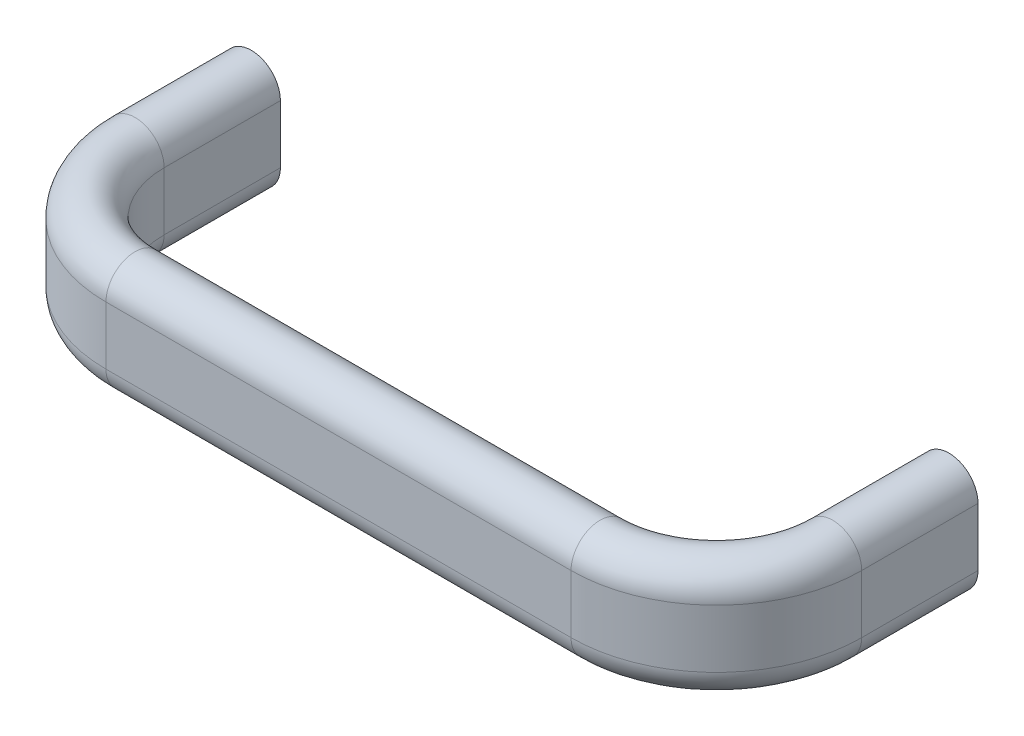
ISO-10303-21;
HEADER;
FILE_DESCRIPTION(('STEP AP214'),'2;1');
FILE_NAME('part.step','',(''),(''),'','','');
FILE_SCHEMA(('AUTOMOTIVE_DESIGN { 1 0 10303 214 1 1 1 1 }'));
ENDSEC;
DATA;
#1=APPLICATION_CONTEXT('core data for automotive mechanical design processes');
#2=APPLICATION_PROTOCOL_DEFINITION('international standard','automotive_design',2000,#1);
#3=PRODUCT_CONTEXT('',#1,'mechanical');
#4=PRODUCT('Part','Part','',(#3));
#5=PRODUCT_RELATED_PRODUCT_CATEGORY('part','',(#4));
#6=PRODUCT_DEFINITION_FORMATION('','',#4);
#7=PRODUCT_DEFINITION_CONTEXT('part definition',#1,'design');
#8=PRODUCT_DEFINITION('design','',#6,#7);
#9=PRODUCT_DEFINITION_SHAPE('','',#8);
#10=(LENGTH_UNIT() NAMED_UNIT(*) SI_UNIT(.MILLI.,.METRE.));
#11=(NAMED_UNIT(*) PLANE_ANGLE_UNIT() SI_UNIT($,.RADIAN.));
#12=(NAMED_UNIT(*) SI_UNIT($,.STERADIAN.) SOLID_ANGLE_UNIT());
#13=UNCERTAINTY_MEASURE_WITH_UNIT(LENGTH_MEASURE(1.E-05),#10,'distance_accuracy_value','');
#14=(GEOMETRIC_REPRESENTATION_CONTEXT(3) GLOBAL_UNCERTAINTY_ASSIGNED_CONTEXT((#13)) GLOBAL_UNIT_ASSIGNED_CONTEXT((#10,
#11,#12)) REPRESENTATION_CONTEXT('',''));
#15=CARTESIAN_POINT('',(0.,0.,0.));
#16=DIRECTION('',(0.,0.,1.));
#17=DIRECTION('',(1.,0.,0.));
#18=AXIS2_PLACEMENT_3D('',#15,#16,#17);
#19=CARTESIAN_POINT('',(-5.,-5.,20.));
#20=DIRECTION('',(-1.,0.,0.));
#21=DIRECTION('',(0.,-1.,0.));
#22=AXIS2_PLACEMENT_3D('',#19,#20,#21);
#23=PLANE('',#22);
#24=DIRECTION('',(0.,1.,0.));
#25=VECTOR('',#24,1.);
#26=CARTESIAN_POINT('',(-5.,-5.,20.));
#27=LINE('',#26,#25);
#28=CARTESIAN_POINT('',(-5.,-5.,20.));
#29=VERTEX_POINT('',#28);
#30=CARTESIAN_POINT('',(-5.,5.,20.));
#31=VERTEX_POINT('',#30);
#32=EDGE_CURVE('E200',#29,#31,#27,.T.);
#33=ORIENTED_EDGE('',*,*,#32,.T.);
#34=DIRECTION('',(0.,0.,-1.));
#35=VECTOR('',#34,1.);
#36=CARTESIAN_POINT('',(-5.,5.,20.));
#37=LINE('',#36,#35);
#38=CARTESIAN_POINT('',(-5.,5.,0.));
#39=VERTEX_POINT('',#38);
#40=EDGE_CURVE('E224',#31,#39,#37,.T.);
#41=ORIENTED_EDGE('',*,*,#40,.T.);
#42=DIRECTION('',(0.,1.,0.));
#43=VECTOR('',#42,1.);
#44=CARTESIAN_POINT('',(-5.,-5.,0.));
#45=LINE('',#44,#43);
#46=CARTESIAN_POINT('',(-5.,-5.,0.));
#47=VERTEX_POINT('',#46);
#48=EDGE_CURVE('E222',#47,#39,#45,.T.);
#49=ORIENTED_EDGE('',*,*,#48,.F.);
#50=DIRECTION('',(0.,0.,-1.));
#51=VECTOR('',#50,1.);
#52=CARTESIAN_POINT('',(-5.,-5.,20.));
#53=LINE('',#52,#51);
#54=EDGE_CURVE('E227',#29,#47,#53,.T.);
#55=ORIENTED_EDGE('',*,*,#54,.F.);
#56=EDGE_LOOP('',(#33,#41,#49,#55));
#57=FACE_BOUND('',#56,.T.);
#58=ADVANCED_FACE('F14',(#57),#23,.T.);
#59=CARTESIAN_POINT('',(0.,5.,20.));
#60=DIRECTION('',(0.,0.,-1.));
#61=DIRECTION('',(0.,-1.,0.));
#62=AXIS2_PLACEMENT_3D('',#59,#60,#61);
#63=CYLINDRICAL_SURFACE('',#62,5.);
#64=CARTESIAN_POINT('',(0.,5.,20.));
#65=DIRECTION('',(0.,0.,-1.));
#66=DIRECTION('',(0.,1.,0.));
#67=AXIS2_PLACEMENT_3D('',#64,#65,#66);
#68=CIRCLE('',#67,5.);
#69=CARTESIAN_POINT('',(5.,5.,20.));
#70=VERTEX_POINT('',#69);
#71=EDGE_CURVE('E213',#31,#70,#68,.T.);
#72=ORIENTED_EDGE('',*,*,#71,.T.);
#73=DIRECTION('',(0.,0.,-1.));
#74=VECTOR('',#73,1.);
#75=CARTESIAN_POINT('',(5.,5.,20.));
#76=LINE('',#75,#74);
#77=CARTESIAN_POINT('',(5.,5.,0.));
#78=VERTEX_POINT('',#77);
#79=EDGE_CURVE('E221',#70,#78,#76,.T.);
#80=ORIENTED_EDGE('',*,*,#79,.T.);
#81=CARTESIAN_POINT('',(0.,5.,0.));
#82=DIRECTION('',(0.,0.,-1.));
#83=DIRECTION('',(0.,1.,0.));
#84=AXIS2_PLACEMENT_3D('',#81,#82,#83);
#85=CIRCLE('',#84,5.);
#86=EDGE_CURVE('E36',#39,#78,#85,.T.);
#87=ORIENTED_EDGE('',*,*,#86,.F.);
#88=ORIENTED_EDGE('',*,*,#40,.F.);
#89=EDGE_LOOP('',(#72,#80,#87,#88));
#90=FACE_BOUND('',#89,.T.);
#91=ADVANCED_FACE('F278',(#90),#63,.T.);
#92=CARTESIAN_POINT('',(5.,5.,20.));
#93=DIRECTION('',(1.,0.,0.));
#94=DIRECTION('',(0.,1.,0.));
#95=AXIS2_PLACEMENT_3D('',#92,#93,#94);
#96=PLANE('',#95);
#97=DIRECTION('',(0.,-1.,0.));
#98=VECTOR('',#97,1.);
#99=CARTESIAN_POINT('',(5.,5.,20.));
#100=LINE('',#99,#98);
#101=CARTESIAN_POINT('',(5.,-5.,20.));
#102=VERTEX_POINT('',#101);
#103=EDGE_CURVE('E210',#70,#102,#100,.T.);
#104=ORIENTED_EDGE('',*,*,#103,.T.);
#105=DIRECTION('',(0.,0.,-1.));
#106=VECTOR('',#105,1.);
#107=CARTESIAN_POINT('',(5.,-5.,20.));
#108=LINE('',#107,#106);
#109=CARTESIAN_POINT('',(5.,-5.,0.));
#110=VERTEX_POINT('',#109);
#111=EDGE_CURVE('E218',#102,#110,#108,.T.);
#112=ORIENTED_EDGE('',*,*,#111,.T.);
#113=DIRECTION('',(0.,-1.,0.));
#114=VECTOR('',#113,1.);
#115=CARTESIAN_POINT('',(5.,5.,0.));
#116=LINE('',#115,#114);
#117=EDGE_CURVE('E231',#78,#110,#116,.T.);
#118=ORIENTED_EDGE('',*,*,#117,.F.);
#119=ORIENTED_EDGE('',*,*,#79,.F.);
#120=EDGE_LOOP('',(#104,#112,#118,#119));
#121=FACE_BOUND('',#120,.T.);
#122=ADVANCED_FACE('F284',(#121),#96,.T.);
#123=CARTESIAN_POINT('',(0.,-5.,20.));
#124=DIRECTION('',(0.,0.,-1.));
#125=DIRECTION('',(0.,-1.,0.));
#126=AXIS2_PLACEMENT_3D('',#123,#124,#125);
#127=CYLINDRICAL_SURFACE('',#126,5.);
#128=CARTESIAN_POINT('',(0.,-5.,20.));
#129=DIRECTION('',(0.,0.,-1.));
#130=DIRECTION('',(0.,1.,0.));
#131=AXIS2_PLACEMENT_3D('',#128,#129,#130);
#132=CIRCLE('',#131,5.);
#133=EDGE_CURVE('E186',#102,#29,#132,.T.);
#134=ORIENTED_EDGE('',*,*,#133,.T.);
#135=ORIENTED_EDGE('',*,*,#54,.T.);
#136=CARTESIAN_POINT('',(0.,-5.,0.));
#137=DIRECTION('',(0.,0.,-1.));
#138=DIRECTION('',(0.,1.,0.));
#139=AXIS2_PLACEMENT_3D('',#136,#137,#138);
#140=CIRCLE('',#139,5.);
#141=EDGE_CURVE('E28',#110,#47,#140,.T.);
#142=ORIENTED_EDGE('',*,*,#141,.F.);
#143=ORIENTED_EDGE('',*,*,#111,.F.);
#144=EDGE_LOOP('',(#134,#135,#142,#143));
#145=FACE_BOUND('',#144,.T.);
#146=ADVANCED_FACE('F303',(#145),#127,.T.);
#147=CARTESIAN_POINT('',(20.,0.,20.));
#148=DIRECTION('',(0.,-1.,0.));
#149=DIRECTION('',(1.,0.,0.));
#150=AXIS2_PLACEMENT_3D('',#147,#148,#149);
#151=CYLINDRICAL_SURFACE('',#150,25.);
#152=DIRECTION('',(0.,1.,0.));
#153=VECTOR('',#152,1.);
#154=CARTESIAN_POINT('',(20.,-5.,45.));
#155=LINE('',#154,#153);
#156=CARTESIAN_POINT('',(20.,-5.,45.));
#157=VERTEX_POINT('',#156);
#158=CARTESIAN_POINT('',(20.,5.,45.));
#159=VERTEX_POINT('',#158);
#160=EDGE_CURVE('E177',#157,#159,#155,.T.);
#161=ORIENTED_EDGE('',*,*,#160,.T.);
#162=CARTESIAN_POINT('',(20.,5.,20.));
#163=DIRECTION('',(0.,-1.,0.));
#164=DIRECTION('',(1.,0.,0.));
#165=AXIS2_PLACEMENT_3D('',#162,#163,#164);
#166=CIRCLE('',#165,25.);
#167=EDGE_CURVE('E203',#159,#31,#166,.T.);
#168=ORIENTED_EDGE('',*,*,#167,.T.);
#169=ORIENTED_EDGE('',*,*,#32,.F.);
#170=CARTESIAN_POINT('',(20.,-5.,20.));
#171=DIRECTION('',(0.,-1.,0.));
#172=DIRECTION('',(1.,0.,0.));
#173=AXIS2_PLACEMENT_3D('',#170,#171,#172);
#174=CIRCLE('',#173,25.);
#175=EDGE_CURVE('E206',#157,#29,#174,.T.);
#176=ORIENTED_EDGE('',*,*,#175,.F.);
#177=EDGE_LOOP('',(#161,#168,#169,#176));
#178=FACE_BOUND('',#177,.T.);
#179=ADVANCED_FACE('F290',(#178),#151,.T.);
#180=CARTESIAN_POINT('',(20.,5.,20.));
#181=DIRECTION('',(0.,-1.,0.));
#182=DIRECTION('',(1.,0.,0.));
#183=AXIS2_PLACEMENT_3D('',#180,#181,#182);
#184=TOROIDAL_SURFACE('',#183,20.,5.);
#185=CARTESIAN_POINT('',(20.,5.,40.));
#186=DIRECTION('',(-1.,0.,0.));
#187=DIRECTION('',(0.,1.,0.));
#188=AXIS2_PLACEMENT_3D('',#185,#186,#187);
#189=CIRCLE('',#188,5.);
#190=CARTESIAN_POINT('',(20.,5.,35.));
#191=VERTEX_POINT('',#190);
#192=EDGE_CURVE('E191',#159,#191,#189,.T.);
#193=ORIENTED_EDGE('',*,*,#192,.T.);
#194=CARTESIAN_POINT('',(20.,5.,20.));
#195=DIRECTION('',(0.,-1.,0.));
#196=DIRECTION('',(1.,0.,0.));
#197=AXIS2_PLACEMENT_3D('',#194,#195,#196);
#198=CIRCLE('',#197,15.);
#199=EDGE_CURVE('E199',#191,#70,#198,.T.);
#200=ORIENTED_EDGE('',*,*,#199,.T.);
#201=ORIENTED_EDGE('',*,*,#71,.F.);
#202=ORIENTED_EDGE('',*,*,#167,.F.);
#203=EDGE_LOOP('',(#193,#200,#201,#202));
#204=FACE_BOUND('',#203,.T.);
#205=ADVANCED_FACE('F293',(#204),#184,.T.);
#206=CARTESIAN_POINT('',(20.,0.,20.));
#207=DIRECTION('',(0.,-1.,0.));
#208=DIRECTION('',(1.,0.,0.));
#209=AXIS2_PLACEMENT_3D('',#206,#207,#208);
#210=CYLINDRICAL_SURFACE('',#209,15.);
#211=DIRECTION('',(0.,-1.,0.));
#212=VECTOR('',#211,1.);
#213=CARTESIAN_POINT('',(20.,5.,35.));
#214=LINE('',#213,#212);
#215=CARTESIAN_POINT('',(20.,-5.,35.));
#216=VERTEX_POINT('',#215);
#217=EDGE_CURVE('E188',#191,#216,#214,.T.);
#218=ORIENTED_EDGE('',*,*,#217,.T.);
#219=CARTESIAN_POINT('',(20.,-5.,20.));
#220=DIRECTION('',(0.,-1.,0.));
#221=DIRECTION('',(1.,0.,0.));
#222=AXIS2_PLACEMENT_3D('',#219,#220,#221);
#223=CIRCLE('',#222,15.);
#224=EDGE_CURVE('E196',#216,#102,#223,.T.);
#225=ORIENTED_EDGE('',*,*,#224,.T.);
#226=ORIENTED_EDGE('',*,*,#103,.F.);
#227=ORIENTED_EDGE('',*,*,#199,.F.);
#228=EDGE_LOOP('',(#218,#225,#226,#227));
#229=FACE_BOUND('',#228,.T.);
#230=ADVANCED_FACE('F297',(#229),#210,.F.);
#231=CARTESIAN_POINT('',(20.,-5.,20.));
#232=DIRECTION('',(0.,-1.,0.));
#233=DIRECTION('',(1.,0.,0.));
#234=AXIS2_PLACEMENT_3D('',#231,#232,#233);
#235=TOROIDAL_SURFACE('',#234,20.,5.);
#236=CARTESIAN_POINT('',(20.,-5.,40.));
#237=DIRECTION('',(-1.,0.,0.));
#238=DIRECTION('',(0.,1.,0.));
#239=AXIS2_PLACEMENT_3D('',#236,#237,#238);
#240=CIRCLE('',#239,5.);
#241=EDGE_CURVE('E163',#216,#157,#240,.T.);
#242=ORIENTED_EDGE('',*,*,#241,.T.);
#243=ORIENTED_EDGE('',*,*,#175,.T.);
#244=ORIENTED_EDGE('',*,*,#133,.F.);
#245=ORIENTED_EDGE('',*,*,#224,.F.);
#246=EDGE_LOOP('',(#242,#243,#244,#245));
#247=FACE_BOUND('',#246,.T.);
#248=ADVANCED_FACE('F301',(#247),#235,.T.);
#249=CARTESIAN_POINT('',(100.,-5.,45.));
#250=DIRECTION('',(0.,0.,1.));
#251=DIRECTION('',(1.,0.,0.));
#252=AXIS2_PLACEMENT_3D('',#249,#250,#251);
#253=PLANE('',#252);
#254=DIRECTION('',(0.,1.,0.));
#255=VECTOR('',#254,1.);
#256=CARTESIAN_POINT('',(100.,-5.,45.));
#257=LINE('',#256,#255);
#258=CARTESIAN_POINT('',(100.,-5.,45.));
#259=VERTEX_POINT('',#258);
#260=CARTESIAN_POINT('',(100.,5.,45.));
#261=VERTEX_POINT('',#260);
#262=EDGE_CURVE('E154',#259,#261,#257,.T.);
#263=ORIENTED_EDGE('',*,*,#262,.T.);
#264=DIRECTION('',(-1.,0.,0.));
#265=VECTOR('',#264,1.);
#266=CARTESIAN_POINT('',(100.,5.,45.));
#267=LINE('',#266,#265);
#268=EDGE_CURVE('E180',#261,#159,#267,.T.);
#269=ORIENTED_EDGE('',*,*,#268,.T.);
#270=ORIENTED_EDGE('',*,*,#160,.F.);
#271=DIRECTION('',(-1.,0.,0.));
#272=VECTOR('',#271,1.);
#273=CARTESIAN_POINT('',(100.,-5.,45.));
#274=LINE('',#273,#272);
#275=EDGE_CURVE('E183',#259,#157,#274,.T.);
#276=ORIENTED_EDGE('',*,*,#275,.F.);
#277=EDGE_LOOP('',(#263,#269,#270,#276));
#278=FACE_BOUND('',#277,.T.);
#279=ADVANCED_FACE('F354',(#278),#253,.T.);
#280=CARTESIAN_POINT('',(100.,5.,40.));
#281=DIRECTION('',(-1.,0.,0.));
#282=DIRECTION('',(0.,0.,1.));
#283=AXIS2_PLACEMENT_3D('',#280,#281,#282);
#284=CYLINDRICAL_SURFACE('',#283,5.);
#285=CARTESIAN_POINT('',(100.,5.,40.));
#286=DIRECTION('',(-1.,0.,0.));
#287=DIRECTION('',(0.,1.,0.));
#288=AXIS2_PLACEMENT_3D('',#285,#286,#287);
#289=CIRCLE('',#288,5.);
#290=CARTESIAN_POINT('',(100.,5.,35.));
#291=VERTEX_POINT('',#290);
#292=EDGE_CURVE('E168',#261,#291,#289,.T.);
#293=ORIENTED_EDGE('',*,*,#292,.T.);
#294=DIRECTION('',(-1.,0.,0.));
#295=VECTOR('',#294,1.);
#296=CARTESIAN_POINT('',(100.,5.,35.));
#297=LINE('',#296,#295);
#298=EDGE_CURVE('E176',#291,#191,#297,.T.);
#299=ORIENTED_EDGE('',*,*,#298,.T.);
#300=ORIENTED_EDGE('',*,*,#192,.F.);
#301=ORIENTED_EDGE('',*,*,#268,.F.);
#302=EDGE_LOOP('',(#293,#299,#300,#301));
#303=FACE_BOUND('',#302,.T.);
#304=ADVANCED_FACE('F350',(#303),#284,.T.);
#305=CARTESIAN_POINT('',(100.,5.,35.));
#306=DIRECTION('',(0.,0.,-1.));
#307=DIRECTION('',(-1.,0.,0.));
#308=AXIS2_PLACEMENT_3D('',#305,#306,#307);
#309=PLANE('',#308);
#310=DIRECTION('',(0.,-1.,0.));
#311=VECTOR('',#310,1.);
#312=CARTESIAN_POINT('',(100.,5.,35.));
#313=LINE('',#312,#311);
#314=CARTESIAN_POINT('',(100.,-5.,35.));
#315=VERTEX_POINT('',#314);
#316=EDGE_CURVE('E165',#291,#315,#313,.T.);
#317=ORIENTED_EDGE('',*,*,#316,.T.);
#318=DIRECTION('',(-1.,0.,0.));
#319=VECTOR('',#318,1.);
#320=CARTESIAN_POINT('',(100.,-5.,35.));
#321=LINE('',#320,#319);
#322=EDGE_CURVE('E173',#315,#216,#321,.T.);
#323=ORIENTED_EDGE('',*,*,#322,.T.);
#324=ORIENTED_EDGE('',*,*,#217,.F.);
#325=ORIENTED_EDGE('',*,*,#298,.F.);
#326=EDGE_LOOP('',(#317,#323,#324,#325));
#327=FACE_BOUND('',#326,.T.);
#328=ADVANCED_FACE('F346',(#327),#309,.T.);
#329=CARTESIAN_POINT('',(100.,-5.,40.));
#330=DIRECTION('',(-1.,0.,0.));
#331=DIRECTION('',(0.,0.,1.));
#332=AXIS2_PLACEMENT_3D('',#329,#330,#331);
#333=CYLINDRICAL_SURFACE('',#332,5.);
#334=CARTESIAN_POINT('',(100.,-5.,40.));
#335=DIRECTION('',(-1.,0.,0.));
#336=DIRECTION('',(0.,1.,0.));
#337=AXIS2_PLACEMENT_3D('',#334,#335,#336);
#338=CIRCLE('',#337,5.);
#339=EDGE_CURVE('E126',#315,#259,#338,.T.);
#340=ORIENTED_EDGE('',*,*,#339,.T.);
#341=ORIENTED_EDGE('',*,*,#275,.T.);
#342=ORIENTED_EDGE('',*,*,#241,.F.);
#343=ORIENTED_EDGE('',*,*,#322,.F.);
#344=EDGE_LOOP('',(#340,#341,#342,#343));
#345=FACE_BOUND('',#344,.T.);
#346=ADVANCED_FACE('F342',(#345),#333,.T.);
#347=CARTESIAN_POINT('',(100.,0.,20.));
#348=DIRECTION('',(0.,-1.,0.));
#349=DIRECTION('',(1.,0.,0.));
#350=AXIS2_PLACEMENT_3D('',#347,#348,#349);
#351=CYLINDRICAL_SURFACE('',#350,25.);
#352=DIRECTION('',(0.,1.,0.));
#353=VECTOR('',#352,1.);
#354=CARTESIAN_POINT('',(125.,-5.,20.));
#355=LINE('',#354,#353);
#356=CARTESIAN_POINT('',(125.,-5.,20.));
#357=VERTEX_POINT('',#356);
#358=CARTESIAN_POINT('',(125.,5.,20.));
#359=VERTEX_POINT('',#358);
#360=EDGE_CURVE('E125',#357,#359,#355,.T.);
#361=ORIENTED_EDGE('',*,*,#360,.T.);
#362=CARTESIAN_POINT('',(100.,5.,20.));
#363=DIRECTION('',(0.,-1.,0.));
#364=DIRECTION('',(1.,0.,0.));
#365=AXIS2_PLACEMENT_3D('',#362,#363,#364);
#366=CIRCLE('',#365,25.);
#367=EDGE_CURVE('E157',#359,#261,#366,.T.);
#368=ORIENTED_EDGE('',*,*,#367,.T.);
#369=ORIENTED_EDGE('',*,*,#262,.F.);
#370=CARTESIAN_POINT('',(100.,-5.,20.));
#371=DIRECTION('',(0.,-1.,0.));
#372=DIRECTION('',(1.,0.,0.));
#373=AXIS2_PLACEMENT_3D('',#370,#371,#372);
#374=CIRCLE('',#373,25.);
#375=EDGE_CURVE('E160',#357,#259,#374,.T.);
#376=ORIENTED_EDGE('',*,*,#375,.F.);
#377=EDGE_LOOP('',(#361,#368,#369,#376));
#378=FACE_BOUND('',#377,.T.);
#379=ADVANCED_FACE('F338',(#378),#351,.T.);
#380=CARTESIAN_POINT('',(100.,5.,20.));
#381=DIRECTION('',(0.,-1.,0.));
#382=DIRECTION('',(1.,0.,0.));
#383=AXIS2_PLACEMENT_3D('',#380,#381,#382);
#384=TOROIDAL_SURFACE('',#383,20.,5.);
#385=CARTESIAN_POINT('',(120.,5.,20.));
#386=DIRECTION('',(0.,0.,1.));
#387=DIRECTION('',(0.,1.,0.));
#388=AXIS2_PLACEMENT_3D('',#385,#386,#387);
#389=CIRCLE('',#388,5.);
#390=CARTESIAN_POINT('',(115.,5.,20.));
#391=VERTEX_POINT('',#390);
#392=EDGE_CURVE('E140',#359,#391,#389,.T.);
#393=ORIENTED_EDGE('',*,*,#392,.T.);
#394=CARTESIAN_POINT('',(100.,5.,20.));
#395=DIRECTION('',(0.,-1.,0.));
#396=DIRECTION('',(1.,0.,0.));
#397=AXIS2_PLACEMENT_3D('',#394,#395,#396);
#398=CIRCLE('',#397,15.);
#399=EDGE_CURVE('E153',#391,#291,#398,.T.);
#400=ORIENTED_EDGE('',*,*,#399,.T.);
#401=ORIENTED_EDGE('',*,*,#292,.F.);
#402=ORIENTED_EDGE('',*,*,#367,.F.);
#403=EDGE_LOOP('',(#393,#400,#401,#402));
#404=FACE_BOUND('',#403,.T.);
#405=ADVANCED_FACE('F334',(#404),#384,.T.);
#406=CARTESIAN_POINT('',(100.,0.,20.));
#407=DIRECTION('',(0.,-1.,0.));
#408=DIRECTION('',(1.,0.,0.));
#409=AXIS2_PLACEMENT_3D('',#406,#407,#408);
#410=CYLINDRICAL_SURFACE('',#409,15.);
#411=DIRECTION('',(0.,-1.,0.));
#412=VECTOR('',#411,1.);
#413=CARTESIAN_POINT('',(115.,5.,20.));
#414=LINE('',#413,#412);
#415=CARTESIAN_POINT('',(115.,-5.,20.));
#416=VERTEX_POINT('',#415);
#417=EDGE_CURVE('E142',#391,#416,#414,.T.);
#418=ORIENTED_EDGE('',*,*,#417,.T.);
#419=CARTESIAN_POINT('',(100.,-5.,20.));
#420=DIRECTION('',(0.,-1.,0.));
#421=DIRECTION('',(1.,0.,0.));
#422=AXIS2_PLACEMENT_3D('',#419,#420,#421);
#423=CIRCLE('',#422,15.);
#424=EDGE_CURVE('E150',#416,#315,#423,.T.);
#425=ORIENTED_EDGE('',*,*,#424,.T.);
#426=ORIENTED_EDGE('',*,*,#316,.F.);
#427=ORIENTED_EDGE('',*,*,#399,.F.);
#428=EDGE_LOOP('',(#418,#425,#426,#427));
#429=FACE_BOUND('',#428,.T.);
#430=ADVANCED_FACE('F330',(#429),#410,.F.);
#431=CARTESIAN_POINT('',(100.,-5.,20.));
#432=DIRECTION('',(0.,-1.,0.));
#433=DIRECTION('',(1.,0.,0.));
#434=AXIS2_PLACEMENT_3D('',#431,#432,#433);
#435=TOROIDAL_SURFACE('',#434,20.,5.);
#436=CARTESIAN_POINT('',(120.,-5.,20.));
#437=DIRECTION('',(0.,0.,1.));
#438=DIRECTION('',(0.,1.,0.));
#439=AXIS2_PLACEMENT_3D('',#436,#437,#438);
#440=CIRCLE('',#439,5.);
#441=EDGE_CURVE('E137',#416,#357,#440,.T.);
#442=ORIENTED_EDGE('',*,*,#441,.T.);
#443=ORIENTED_EDGE('',*,*,#375,.T.);
#444=ORIENTED_EDGE('',*,*,#339,.F.);
#445=ORIENTED_EDGE('',*,*,#424,.F.);
#446=EDGE_LOOP('',(#442,#443,#444,#445));
#447=FACE_BOUND('',#446,.T.);
#448=ADVANCED_FACE('F327',(#447),#435,.T.);
#449=CARTESIAN_POINT('',(120.,-5.,20.));
#450=DIRECTION('',(0.,0.,-1.));
#451=DIRECTION('',(-1.,0.,0.));
#452=AXIS2_PLACEMENT_3D('',#449,#450,#451);
#453=CYLINDRICAL_SURFACE('',#452,5.);
#454=DIRECTION('',(0.,0.,-1.));
#455=VECTOR('',#454,1.);
#456=CARTESIAN_POINT('',(125.,-5.,20.));
#457=LINE('',#456,#455);
#458=CARTESIAN_POINT('',(125.,-5.,-1.49167968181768E-13));
#459=VERTEX_POINT('',#458);
#460=EDGE_CURVE('E108',#357,#459,#457,.T.);
#461=ORIENTED_EDGE('',*,*,#460,.F.);
#462=ORIENTED_EDGE('',*,*,#441,.F.);
#463=DIRECTION('',(0.,0.,-1.));
#464=VECTOR('',#463,1.);
#465=CARTESIAN_POINT('',(115.,-5.,20.));
#466=LINE('',#465,#464);
#467=CARTESIAN_POINT('',(115.,-5.,-1.43151412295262E-13));
#468=VERTEX_POINT('',#467);
#469=EDGE_CURVE('E111',#416,#468,#466,.T.);
#470=ORIENTED_EDGE('',*,*,#469,.T.);
#471=CARTESIAN_POINT('',(120.,-5.,-1.46159690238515E-13));
#472=DIRECTION('',(0.,0.,1.));
#473=DIRECTION('',(0.,1.,0.));
#474=AXIS2_PLACEMENT_3D('',#471,#472,#473);
#475=CIRCLE('',#474,5.);
#476=EDGE_CURVE('E104',#468,#459,#475,.T.);
#477=ORIENTED_EDGE('',*,*,#476,.T.);
#478=EDGE_LOOP('',(#461,#462,#470,#477));
#479=FACE_BOUND('',#478,.T.);
#480=ADVANCED_FACE('F106',(#479),#453,.T.);
#481=CARTESIAN_POINT('',(125.,-5.,20.));
#482=DIRECTION('',(-1.,0.,0.));
#483=DIRECTION('',(0.,0.,1.));
#484=AXIS2_PLACEMENT_3D('',#481,#482,#483);
#485=PLANE('',#484);
#486=DIRECTION('',(0.,0.,-1.));
#487=VECTOR('',#486,1.);
#488=CARTESIAN_POINT('',(125.,5.,20.));
#489=LINE('',#488,#487);
#490=CARTESIAN_POINT('',(125.,5.,-1.49167968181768E-13));
#491=VERTEX_POINT('',#490);
#492=EDGE_CURVE('E127',#359,#491,#489,.T.);
#493=ORIENTED_EDGE('',*,*,#492,.F.);
#494=ORIENTED_EDGE('',*,*,#360,.F.);
#495=ORIENTED_EDGE('',*,*,#460,.T.);
#496=DIRECTION('',(0.,1.,0.));
#497=VECTOR('',#496,1.);
#498=CARTESIAN_POINT('',(125.,-5.,-1.49167968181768E-13));
#499=LINE('',#498,#497);
#500=EDGE_CURVE('E116',#459,#491,#499,.T.);
#501=ORIENTED_EDGE('',*,*,#500,.T.);
#502=EDGE_LOOP('',(#493,#494,#495,#501));
#503=FACE_BOUND('',#502,.T.);
#504=ADVANCED_FACE('F122',(#503),#485,.F.);
#505=CARTESIAN_POINT('',(120.,5.,20.));
#506=DIRECTION('',(0.,0.,-1.));
#507=DIRECTION('',(-1.,0.,0.));
#508=AXIS2_PLACEMENT_3D('',#505,#506,#507);
#509=CYLINDRICAL_SURFACE('',#508,5.);
#510=DIRECTION('',(0.,0.,-1.));
#511=VECTOR('',#510,1.);
#512=CARTESIAN_POINT('',(115.,5.,20.));
#513=LINE('',#512,#511);
#514=CARTESIAN_POINT('',(115.,5.,-1.43151412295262E-13));
#515=VERTEX_POINT('',#514);
#516=EDGE_CURVE('E146',#391,#515,#513,.T.);
#517=ORIENTED_EDGE('',*,*,#516,.F.);
#518=ORIENTED_EDGE('',*,*,#392,.F.);
#519=ORIENTED_EDGE('',*,*,#492,.T.);
#520=CARTESIAN_POINT('',(120.,5.,-1.46159690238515E-13));
#521=DIRECTION('',(0.,0.,1.));
#522=DIRECTION('',(0.,1.,0.));
#523=AXIS2_PLACEMENT_3D('',#520,#521,#522);
#524=CIRCLE('',#523,5.);
#525=EDGE_CURVE('E130',#491,#515,#524,.T.);
#526=ORIENTED_EDGE('',*,*,#525,.T.);
#527=EDGE_LOOP('',(#517,#518,#519,#526));
#528=FACE_BOUND('',#527,.T.);
#529=ADVANCED_FACE('F307',(#528),#509,.T.);
#530=CARTESIAN_POINT('',(115.,5.,20.));
#531=DIRECTION('',(1.,0.,0.));
#532=DIRECTION('',(0.,0.,-1.));
#533=AXIS2_PLACEMENT_3D('',#530,#531,#532);
#534=PLANE('',#533);
#535=ORIENTED_EDGE('',*,*,#417,.F.);
#536=ORIENTED_EDGE('',*,*,#516,.T.);
#537=DIRECTION('',(0.,-1.,0.));
#538=VECTOR('',#537,1.);
#539=CARTESIAN_POINT('',(115.,5.,-1.43151412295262E-13));
#540=LINE('',#539,#538);
#541=EDGE_CURVE('E132',#515,#468,#540,.T.);
#542=ORIENTED_EDGE('',*,*,#541,.T.);
#543=ORIENTED_EDGE('',*,*,#469,.F.);
#544=EDGE_LOOP('',(#535,#536,#542,#543));
#545=FACE_BOUND('',#544,.T.);
#546=ADVANCED_FACE('F275',(#545),#534,.F.);
#547=CARTESIAN_POINT('',(0.,-5.,0.));
#548=DIRECTION('',(0.,0.,-1.));
#549=DIRECTION('',(0.,1.,0.));
#550=AXIS2_PLACEMENT_3D('',#547,#548,#549);
#551=PLANE('',#550);
#552=CARTESIAN_POINT('',(0.,0.,0.));
#553=DIRECTION('',(0.,0.,-1.));
#554=DIRECTION('',(-1.,0.,0.));
#555=AXIS2_PLACEMENT_3D('',#552,#553,#554);
#556=CIRCLE('',#555,2.96700000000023);
#557=CARTESIAN_POINT('',(-2.96700000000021,0.,0.));
#558=VERTEX_POINT('',#557);
#559=EDGE_CURVE('E250',#558,#558,#556,.T.);
#560=ORIENTED_EDGE('',*,*,#559,.F.);
#561=EDGE_LOOP('',(#560));
#562=FACE_BOUND('',#561,.T.);
#563=ORIENTED_EDGE('',*,*,#141,.T.);
#564=ORIENTED_EDGE('',*,*,#48,.T.);
#565=ORIENTED_EDGE('',*,*,#86,.T.);
#566=ORIENTED_EDGE('',*,*,#117,.T.);
#567=EDGE_LOOP('',(#563,#564,#565,#566));
#568=FACE_BOUND('',#567,.T.);
#569=ADVANCED_FACE('F272',(#562,#568),#551,.T.);
#570=CARTESIAN_POINT('',(120.,-5.,-1.46159690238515E-13));
#571=DIRECTION('',(0.,0.,1.));
#572=DIRECTION('',(0.,1.,0.));
#573=AXIS2_PLACEMENT_3D('',#570,#571,#572);
#574=PLANE('',#573);
#575=CARTESIAN_POINT('',(120.,0.,-1.46159690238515E-13));
#576=DIRECTION('',(0.,0.,1.));
#577=DIRECTION('',(1.,0.,0.));
#578=AXIS2_PLACEMENT_3D('',#575,#576,#577);
#579=CIRCLE('',#578,2.96700000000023);
#580=CARTESIAN_POINT('',(122.967,0.,-1.48881500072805E-13));
#581=VERTEX_POINT('',#580);
#582=EDGE_CURVE('E249',#581,#581,#579,.T.);
#583=ORIENTED_EDGE('',*,*,#582,.T.);
#584=EDGE_LOOP('',(#583));
#585=FACE_BOUND('',#584,.T.);
#586=ORIENTED_EDGE('',*,*,#476,.F.);
#587=ORIENTED_EDGE('',*,*,#541,.F.);
#588=ORIENTED_EDGE('',*,*,#525,.F.);
#589=ORIENTED_EDGE('',*,*,#500,.F.);
#590=EDGE_LOOP('',(#586,#587,#588,#589));
#591=FACE_BOUND('',#590,.T.);
#592=ADVANCED_FACE('F129',(#585,#591),#574,.F.);
#593=CARTESIAN_POINT('',(120.,0.,15.6933830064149));
#594=DIRECTION('',(0.,0.,1.));
#595=DIRECTION('',(1.,0.,0.));
#596=AXIS2_PLACEMENT_3D('',#593,#594,#595);
#597=CYLINDRICAL_SURFACE('',#596,2.5);
#598=CARTESIAN_POINT('',(120.,0.,10.));
#599=DIRECTION('',(0.,0.,-1.));
#600=DIRECTION('',(-1.,0.,0.));
#601=AXIS2_PLACEMENT_3D('',#598,#599,#600);
#602=CIRCLE('',#601,2.5);
#603=CARTESIAN_POINT('',(117.5,0.,10.));
#604=VERTEX_POINT('',#603);
#605=EDGE_CURVE('E9',#604,#604,#602,.T.);
#606=ORIENTED_EDGE('',*,*,#605,.F.);
#607=EDGE_LOOP('',(#606));
#608=FACE_BOUND('',#607,.T.);
#609=CARTESIAN_POINT('',(120.,0.,0.467000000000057));
#610=DIRECTION('',(0.,0.,1.));
#611=DIRECTION('',(1.,0.,0.));
#612=AXIS2_PLACEMENT_3D('',#609,#610,#611);
#613=CIRCLE('',#612,2.5);
#614=CARTESIAN_POINT('',(122.5,0.,0.467000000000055));
#615=VERTEX_POINT('',#614);
#616=EDGE_CURVE('E117',#615,#615,#613,.T.);
#617=ORIENTED_EDGE('',*,*,#616,.F.);
#618=EDGE_LOOP('',(#617));
#619=FACE_BOUND('',#618,.T.);
#620=ADVANCED_FACE('F260',(#608,#619),#597,.F.);
#621=CARTESIAN_POINT('',(120.,0.,0.467000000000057));
#622=DIRECTION('',(0.,0.,-1.));
#623=DIRECTION('',(-1.,0.,0.));
#624=AXIS2_PLACEMENT_3D('',#621,#622,#623);
#625=CONICAL_SURFACE('',#624,2.5,0.785398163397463);
#626=ORIENTED_EDGE('',*,*,#582,.F.);
#627=EDGE_LOOP('',(#626));
#628=FACE_BOUND('',#627,.T.);
#629=ORIENTED_EDGE('',*,*,#616,.T.);
#630=EDGE_LOOP('',(#629));
#631=FACE_BOUND('',#630,.T.);
#632=ADVANCED_FACE('F243',(#628,#631),#625,.F.);
#633=CARTESIAN_POINT('',(0.,0.,15.6933830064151));
#634=DIRECTION('',(0.,0.,1.));
#635=DIRECTION('',(-1.,0.,0.));
#636=AXIS2_PLACEMENT_3D('',#633,#634,#635);
#637=CYLINDRICAL_SURFACE('',#636,2.5);
#638=CARTESIAN_POINT('',(0.,0.,10.));
#639=DIRECTION('',(0.,0.,-1.));
#640=DIRECTION('',(-1.,0.,0.));
#641=AXIS2_PLACEMENT_3D('',#638,#639,#640);
#642=CIRCLE('',#641,2.5);
#643=CARTESIAN_POINT('',(-2.49999999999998,0.,10.));
#644=VERTEX_POINT('',#643);
#645=EDGE_CURVE('E21',#644,#644,#642,.T.);
#646=ORIENTED_EDGE('',*,*,#645,.F.);
#647=EDGE_LOOP('',(#646));
#648=FACE_BOUND('',#647,.T.);
#649=CARTESIAN_POINT('',(0.,0.,0.467000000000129));
#650=DIRECTION('',(0.,0.,-1.));
#651=DIRECTION('',(-1.,0.,0.));
#652=AXIS2_PLACEMENT_3D('',#649,#650,#651);
#653=CIRCLE('',#652,2.5);
#654=CARTESIAN_POINT('',(-2.49999999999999,0.,0.46700000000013));
#655=VERTEX_POINT('',#654);
#656=EDGE_CURVE('E247',#655,#655,#653,.T.);
#657=ORIENTED_EDGE('',*,*,#656,.T.);
#658=EDGE_LOOP('',(#657));
#659=FACE_BOUND('',#658,.T.);
#660=ADVANCED_FACE('F239',(#648,#659),#637,.F.);
#661=CARTESIAN_POINT('',(0.,0.,0.467000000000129));
#662=DIRECTION('',(0.,0.,-1.));
#663=DIRECTION('',(1.,0.,0.));
#664=AXIS2_PLACEMENT_3D('',#661,#662,#663);
#665=CONICAL_SURFACE('',#664,2.5,0.785398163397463);
#666=ORIENTED_EDGE('',*,*,#559,.T.);
#667=EDGE_LOOP('',(#666));
#668=FACE_BOUND('',#667,.T.);
#669=ORIENTED_EDGE('',*,*,#656,.F.);
#670=EDGE_LOOP('',(#669));
#671=FACE_BOUND('',#670,.T.);
#672=ADVANCED_FACE('F242',(#668,#671),#665,.F.);
#673=CARTESIAN_POINT('',(0.,0.,10.));
#674=DIRECTION('',(0.,0.,-1.));
#675=DIRECTION('',(-1.,0.,0.));
#676=AXIS2_PLACEMENT_3D('',#673,#674,#675);
#677=PLANE('',#676);
#678=ORIENTED_EDGE('',*,*,#645,.T.);
#679=EDGE_LOOP('',(#678));
#680=FACE_BOUND('',#679,.T.);
#681=ADVANCED_FACE('F237',(#680),#677,.T.);
#682=CARTESIAN_POINT('',(120.,0.,10.));
#683=DIRECTION('',(0.,0.,-1.));
#684=DIRECTION('',(-1.,0.,0.));
#685=AXIS2_PLACEMENT_3D('',#682,#683,#684);
#686=PLANE('',#685);
#687=ORIENTED_EDGE('',*,*,#605,.T.);
#688=EDGE_LOOP('',(#687));
#689=FACE_BOUND('',#688,.T.);
#690=ADVANCED_FACE('F512',(#689),#686,.T.);
#691=CLOSED_SHELL('',(#58,#91,#122,#146,#179,#205,#230,#248,#279,#304,#328,#346,#379,#405,#430,
#448,#480,#504,#529,#546,#569,#592,#620,#632,#660,#672,#681,#690));
#692=MANIFOLD_SOLID_BREP('B1',#691);
#693=ADVANCED_BREP_SHAPE_REPRESENTATION('',(#18,#692),#14);
#694=SHAPE_DEFINITION_REPRESENTATION(#9,#693);
ENDSEC;
END-ISO-10303-21;
